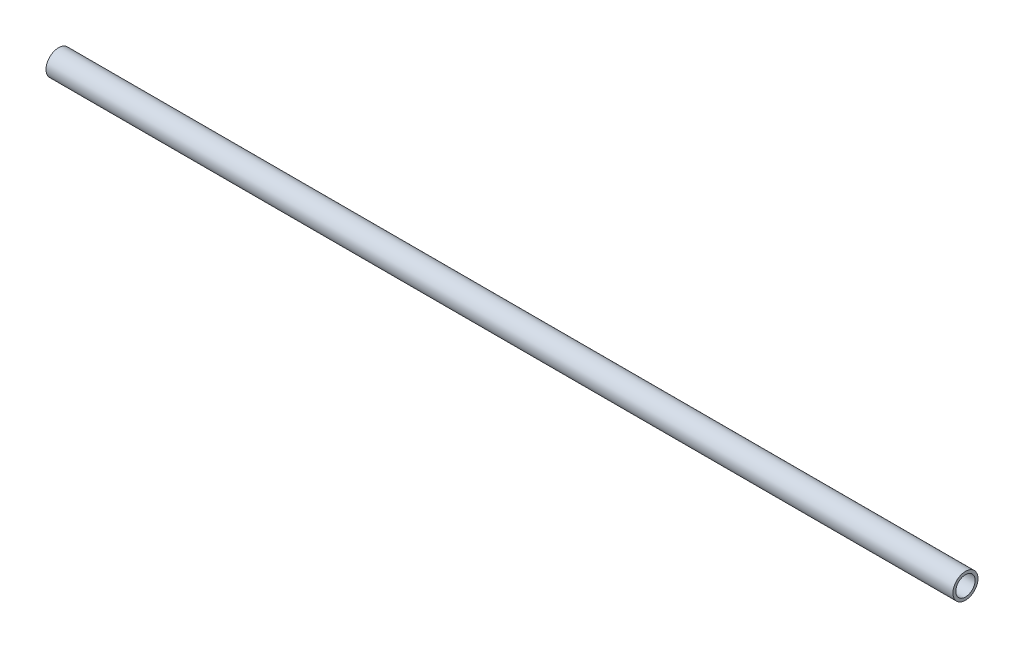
ISO-10303-21;
HEADER;
FILE_DESCRIPTION(('STEP AP214'),'2;1');
FILE_NAME('part.step','',(''),(''),'','','');
FILE_SCHEMA(('AUTOMOTIVE_DESIGN { 1 0 10303 214 1 1 1 1 }'));
ENDSEC;
DATA;
#1=APPLICATION_CONTEXT('core data for automotive mechanical design processes');
#2=APPLICATION_PROTOCOL_DEFINITION('international standard','automotive_design',2000,#1);
#3=PRODUCT_CONTEXT('',#1,'mechanical');
#4=PRODUCT('Part','Part','',(#3));
#5=PRODUCT_RELATED_PRODUCT_CATEGORY('part','',(#4));
#6=PRODUCT_DEFINITION_FORMATION('','',#4);
#7=PRODUCT_DEFINITION_CONTEXT('part definition',#1,'design');
#8=PRODUCT_DEFINITION('design','',#6,#7);
#9=PRODUCT_DEFINITION_SHAPE('','',#8);
#10=(LENGTH_UNIT() NAMED_UNIT(*) SI_UNIT(.MILLI.,.METRE.));
#11=(NAMED_UNIT(*) PLANE_ANGLE_UNIT() SI_UNIT($,.RADIAN.));
#12=(NAMED_UNIT(*) SI_UNIT($,.STERADIAN.) SOLID_ANGLE_UNIT());
#13=UNCERTAINTY_MEASURE_WITH_UNIT(LENGTH_MEASURE(1.E-05),#10,'distance_accuracy_value','');
#14=(GEOMETRIC_REPRESENTATION_CONTEXT(3) GLOBAL_UNCERTAINTY_ASSIGNED_CONTEXT((#13)) GLOBAL_UNIT_ASSIGNED_CONTEXT((#10,
#11,#12)) REPRESENTATION_CONTEXT('',''));
#15=CARTESIAN_POINT('',(0.,0.,0.));
#16=DIRECTION('',(0.,0.,1.));
#17=DIRECTION('',(1.,0.,0.));
#18=AXIS2_PLACEMENT_3D('',#15,#16,#17);
#19=CARTESIAN_POINT('',(1193.8,0.,0.));
#20=DIRECTION('',(-1.,0.,0.));
#21=DIRECTION('',(0.,0.,1.));
#22=AXIS2_PLACEMENT_3D('',#19,#20,#21);
#23=CYLINDRICAL_SURFACE('',#22,12.7);
#24=CARTESIAN_POINT('',(1193.8,0.,0.));
#25=DIRECTION('',(1.,0.,0.));
#26=DIRECTION('',(0.,0.,-1.));
#27=AXIS2_PLACEMENT_3D('',#24,#25,#26);
#28=CIRCLE('',#27,12.7);
#29=CARTESIAN_POINT('',(1193.8,0.,-12.7));
#30=VERTEX_POINT('',#29);
#31=EDGE_CURVE('E42',#30,#30,#28,.T.);
#32=ORIENTED_EDGE('',*,*,#31,.T.);
#33=EDGE_LOOP('',(#32));
#34=FACE_BOUND('',#33,.T.);
#35=CARTESIAN_POINT('',(0.,0.,0.));
#36=DIRECTION('',(1.,0.,0.));
#37=DIRECTION('',(0.,0.,-1.));
#38=AXIS2_PLACEMENT_3D('',#35,#36,#37);
#39=CIRCLE('',#38,12.7);
#40=CARTESIAN_POINT('',(0.,0.,-12.7));
#41=VERTEX_POINT('',#40);
#42=EDGE_CURVE('E48',#41,#41,#39,.T.);
#43=ORIENTED_EDGE('',*,*,#42,.F.);
#44=EDGE_LOOP('',(#43));
#45=FACE_BOUND('',#44,.T.);
#46=ADVANCED_FACE('F35',(#34,#45),#23,.F.);
#47=CARTESIAN_POINT('',(1193.8,0.,0.));
#48=DIRECTION('',(-1.,0.,0.));
#49=DIRECTION('',(0.,0.,1.));
#50=AXIS2_PLACEMENT_3D('',#47,#48,#49);
#51=CYLINDRICAL_SURFACE('',#50,16.51);
#52=CARTESIAN_POINT('',(1193.8,0.,0.));
#53=DIRECTION('',(1.,0.,0.));
#54=DIRECTION('',(0.,0.,-1.));
#55=AXIS2_PLACEMENT_3D('',#52,#53,#54);
#56=CIRCLE('',#55,16.51);
#57=CARTESIAN_POINT('',(1193.8,0.,-16.51));
#58=VERTEX_POINT('',#57);
#59=EDGE_CURVE('E10',#58,#58,#56,.T.);
#60=ORIENTED_EDGE('',*,*,#59,.F.);
#61=EDGE_LOOP('',(#60));
#62=FACE_BOUND('',#61,.T.);
#63=CARTESIAN_POINT('',(0.,0.,0.));
#64=DIRECTION('',(1.,0.,0.));
#65=DIRECTION('',(0.,0.,-1.));
#66=AXIS2_PLACEMENT_3D('',#63,#64,#65);
#67=CIRCLE('',#66,16.51);
#68=CARTESIAN_POINT('',(0.,0.,-16.51));
#69=VERTEX_POINT('',#68);
#70=EDGE_CURVE('E38',#69,#69,#67,.T.);
#71=ORIENTED_EDGE('',*,*,#70,.T.);
#72=EDGE_LOOP('',(#71));
#73=FACE_BOUND('',#72,.T.);
#74=ADVANCED_FACE('F55',(#62,#73),#51,.T.);
#75=CARTESIAN_POINT('',(1193.8,0.,0.));
#76=DIRECTION('',(1.,0.,0.));
#77=DIRECTION('',(0.,0.,-1.));
#78=AXIS2_PLACEMENT_3D('',#75,#76,#77);
#79=PLANE('',#78);
#80=ORIENTED_EDGE('',*,*,#31,.F.);
#81=EDGE_LOOP('',(#80));
#82=FACE_BOUND('',#81,.T.);
#83=ORIENTED_EDGE('',*,*,#59,.T.);
#84=EDGE_LOOP('',(#83));
#85=FACE_BOUND('',#84,.T.);
#86=ADVANCED_FACE('F59',(#82,#85),#79,.T.);
#87=CARTESIAN_POINT('',(0.,0.,0.));
#88=DIRECTION('',(1.,0.,0.));
#89=DIRECTION('',(0.,0.,-1.));
#90=AXIS2_PLACEMENT_3D('',#87,#88,#89);
#91=PLANE('',#90);
#92=ORIENTED_EDGE('',*,*,#42,.T.);
#93=EDGE_LOOP('',(#92));
#94=FACE_BOUND('',#93,.T.);
#95=ORIENTED_EDGE('',*,*,#70,.F.);
#96=EDGE_LOOP('',(#95));
#97=FACE_BOUND('',#96,.T.);
#98=ADVANCED_FACE('F57',(#94,#97),#91,.F.);
#99=CLOSED_SHELL('',(#46,#74,#86,#98));
#100=MANIFOLD_SOLID_BREP('B2',#99);
#101=ADVANCED_BREP_SHAPE_REPRESENTATION('',(#18,#100),#14);
#102=SHAPE_DEFINITION_REPRESENTATION(#9,#101);
ENDSEC;
END-ISO-10303-21;
